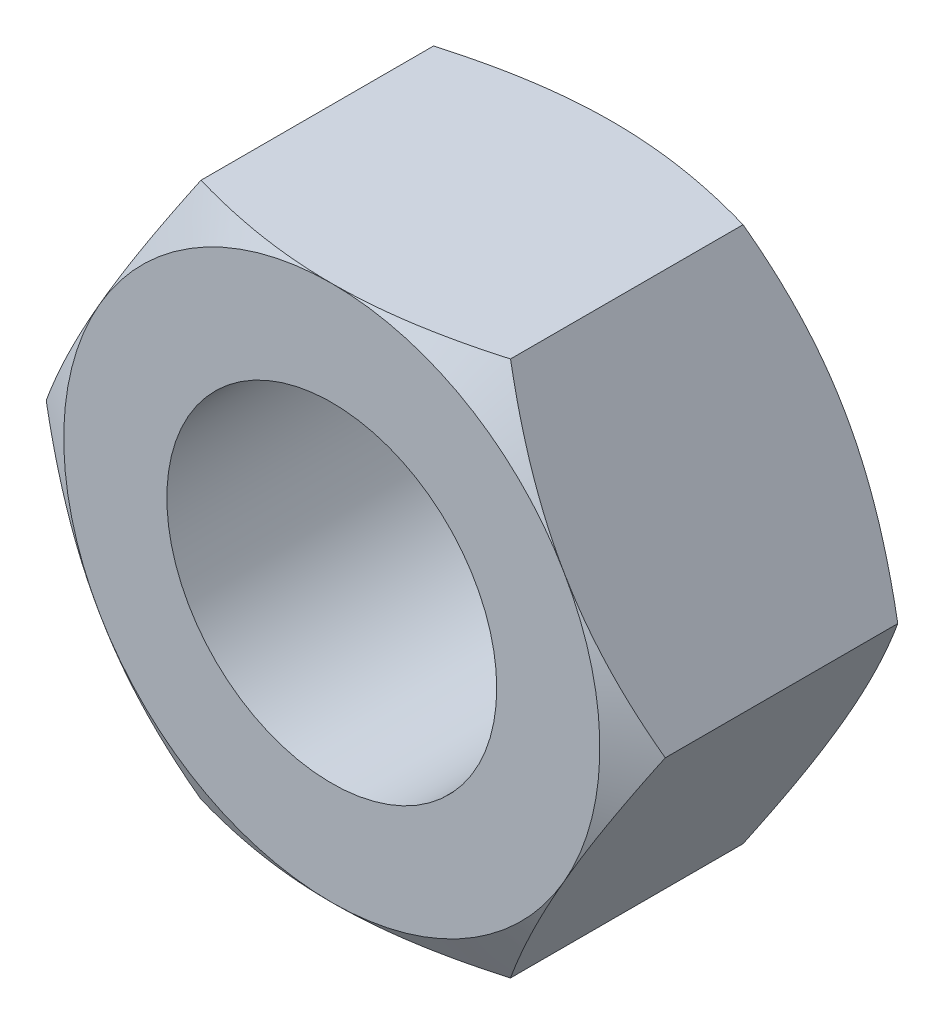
ISO-10303-21;
HEADER;
FILE_DESCRIPTION(('STEP AP214'),'2;1');
FILE_NAME('part.step','',(''),(''),'','','');
FILE_SCHEMA(('AUTOMOTIVE_DESIGN { 1 0 10303 214 1 1 1 1 }'));
ENDSEC;
DATA;
#1=APPLICATION_CONTEXT('core data for automotive mechanical design processes');
#2=APPLICATION_PROTOCOL_DEFINITION('international standard','automotive_design',2000,#1);
#3=PRODUCT_CONTEXT('',#1,'mechanical');
#4=PRODUCT('Part','Part','',(#3));
#5=PRODUCT_RELATED_PRODUCT_CATEGORY('part','',(#4));
#6=PRODUCT_DEFINITION_FORMATION('','',#4);
#7=PRODUCT_DEFINITION_CONTEXT('part definition',#1,'design');
#8=PRODUCT_DEFINITION('design','',#6,#7);
#9=PRODUCT_DEFINITION_SHAPE('','',#8);
#10=(LENGTH_UNIT() NAMED_UNIT(*) SI_UNIT(.MILLI.,.METRE.));
#11=(NAMED_UNIT(*) PLANE_ANGLE_UNIT() SI_UNIT($,.RADIAN.));
#12=(NAMED_UNIT(*) SI_UNIT($,.STERADIAN.) SOLID_ANGLE_UNIT());
#13=UNCERTAINTY_MEASURE_WITH_UNIT(LENGTH_MEASURE(1.E-05),#10,'distance_accuracy_value','');
#14=(GEOMETRIC_REPRESENTATION_CONTEXT(3) GLOBAL_UNCERTAINTY_ASSIGNED_CONTEXT((#13)) GLOBAL_UNIT_ASSIGNED_CONTEXT((#10,
#11,#12)) REPRESENTATION_CONTEXT('',''));
#15=CARTESIAN_POINT('',(0.,0.,0.));
#16=DIRECTION('',(0.,0.,1.));
#17=DIRECTION('',(1.,0.,0.));
#18=AXIS2_PLACEMENT_3D('',#15,#16,#17);
#19=CARTESIAN_POINT('',(-7.5055534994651,0.,6.80000000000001));
#20=DIRECTION('',(0.86602540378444,-0.499999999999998,0.));
#21=DIRECTION('',(0.499999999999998,0.86602540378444,0.));
#22=AXIS2_PLACEMENT_3D('',#19,#20,#21);
#23=PLANE('',#22);
#24=DIRECTION('',(0.,0.,-1.));
#25=VECTOR('',#24,1.);
#26=CARTESIAN_POINT('',(-7.5055534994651,0.,6.80000000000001));
#27=LINE('',#26,#25);
#28=CARTESIAN_POINT('',(-7.5055534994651,0.,6.21944341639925));
#29=VERTEX_POINT('',#28);
#30=CARTESIAN_POINT('',(-7.5055534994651,0.,0.580556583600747));
#31=VERTEX_POINT('',#30);
#32=EDGE_CURVE('E135',#29,#31,#27,.T.);
#33=ORIENTED_EDGE('',*,*,#32,.F.);
#34=CARTESIAN_POINT('',(-7.50566896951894,-0.000200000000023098,6.21937674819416));
#35=CARTESIAN_POINT('',(-7.42317863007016,0.142677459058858,6.26699557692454));
#36=CARTESIAN_POINT('',(-7.34038072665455,0.286087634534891,6.31245329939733));
#37=CARTESIAN_POINT('',(-7.17411251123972,0.574072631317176,6.39845131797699));
#38=CARTESIAN_POINT('',(-7.09064192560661,0.718647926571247,6.43898949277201));
#39=CARTESIAN_POINT('',(-6.83889369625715,1.15468865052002,6.55242899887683));
#40=CARTESIAN_POINT('',(-6.66962231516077,1.44787528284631,6.6169521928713));
#41=CARTESIAN_POINT('',(-6.41631077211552,1.88662374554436,6.69261341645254));
#42=CARTESIAN_POINT('',(-6.33302748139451,2.03087463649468,6.71416714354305));
#43=CARTESIAN_POINT('',(-6.1660845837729,2.32002821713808,6.75030968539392));
#44=CARTESIAN_POINT('',(-6.0824250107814,2.46493084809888,6.76489911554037));
#45=CARTESIAN_POINT('',(-5.91496056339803,2.75498777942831,6.78674124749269));
#46=CARTESIAN_POINT('',(-5.83115596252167,2.9001416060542,6.79400227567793));
#47=CARTESIAN_POINT('',(-5.66347396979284,3.19057533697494,6.8010396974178));
#48=CARTESIAN_POINT('',(-5.57959658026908,3.33585523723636,6.80081632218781));
#49=CARTESIAN_POINT('',(-5.34979921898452,3.7338759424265,6.78991654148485));
#50=CARTESIAN_POINT('',(-5.20395446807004,3.98648646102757,6.77161818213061));
#51=CARTESIAN_POINT('',(-4.91323365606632,4.49002967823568,6.71359365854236));
#52=CARTESIAN_POINT('',(-4.76835861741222,4.74096060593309,6.67384766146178));
#53=CARTESIAN_POINT('',(-4.47705272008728,5.24551722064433,6.57449409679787));
#54=CARTESIAN_POINT('',(-4.33065861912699,5.49907924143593,6.51446557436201));
#55=CARTESIAN_POINT('',(-4.0400535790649,6.00242193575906,6.37822500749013));
#56=CARTESIAN_POINT('',(-3.89583891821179,6.25220905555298,6.30204496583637));
#57=CARTESIAN_POINT('',(-3.75266127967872,6.5002,6.21937674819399));
#58=B_SPLINE_CURVE_WITH_KNOTS('',3,(#34,#35,#36,#37,#38,#39,#40,#41,#42,#43,#44,#45,#46,#47,#48,
#49,#50,#51,#52,#53,#54,#55,#56,#57),.UNSPECIFIED.,.F.,.F.,(4,2,2,2,2,2,2,2,2,2,2,4),(0.,
0.515105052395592,1.03043143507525,2.06322554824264,2.56697389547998,3.07067772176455,
3.57380860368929,4.07692394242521,4.95279354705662,5.82947446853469,6.7255991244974,
7.61996451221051),.UNSPECIFIED.);
#59=CARTESIAN_POINT('',(-5.62916512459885,3.24999999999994,6.80000000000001));
#60=VERTEX_POINT('',#59);
#61=EDGE_CURVE('E118',#29,#60,#58,.T.);
#62=ORIENTED_EDGE('',*,*,#61,.T.);
#63=CARTESIAN_POINT('',(-3.7527767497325,6.5,6.21944341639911));
#64=VERTEX_POINT('',#63);
#65=EDGE_CURVE('E128',#60,#64,#58,.T.);
#66=ORIENTED_EDGE('',*,*,#65,.T.);
#67=DIRECTION('',(0.,0.,-1.));
#68=VECTOR('',#67,1.);
#69=CARTESIAN_POINT('',(-3.75277674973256,6.5,6.79999999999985));
#70=LINE('',#69,#68);
#71=CARTESIAN_POINT('',(-3.75277674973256,6.49999999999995,0.580556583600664));
#72=VERTEX_POINT('',#71);
#73=EDGE_CURVE('E158',#64,#72,#70,.T.);
#74=ORIENTED_EDGE('',*,*,#73,.T.);
#75=CARTESIAN_POINT('',(-3.75266127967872,6.50019999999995,0.580623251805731));
#76=CARTESIAN_POINT('',(-3.83515161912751,6.35732254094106,0.533004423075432));
#77=CARTESIAN_POINT('',(-3.91794952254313,6.21391236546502,0.487546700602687));
#78=CARTESIAN_POINT('',(-4.08421773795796,5.92592736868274,0.401548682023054));
#79=CARTESIAN_POINT('',(-4.16768832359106,5.78135207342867,0.361010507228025));
#80=CARTESIAN_POINT('',(-4.41943655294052,5.34531134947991,0.247571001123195));
#81=CARTESIAN_POINT('',(-4.5887079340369,5.05212471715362,0.183047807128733));
#82=CARTESIAN_POINT('',(-4.84201947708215,4.61337625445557,0.107386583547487));
#83=CARTESIAN_POINT('',(-4.92530276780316,4.46912536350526,0.0858328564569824));
#84=CARTESIAN_POINT('',(-5.09224566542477,4.17997178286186,0.049690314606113));
#85=CARTESIAN_POINT('',(-5.17590523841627,4.03506915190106,0.0351008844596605));
#86=CARTESIAN_POINT('',(-5.34336968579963,3.74501222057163,0.0132587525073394));
#87=CARTESIAN_POINT('',(-5.42717428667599,3.59985839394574,0.00599772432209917));
#88=CARTESIAN_POINT('',(-5.59485627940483,3.309424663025,-0.00103969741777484));
#89=CARTESIAN_POINT('',(-5.67873366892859,3.16414476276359,-0.000816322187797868));
#90=CARTESIAN_POINT('',(-5.90853103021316,2.76612405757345,0.0100834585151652));
#91=CARTESIAN_POINT('',(-6.05437578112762,2.51351353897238,0.0283818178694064));
#92=CARTESIAN_POINT('',(-6.34509659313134,2.00997032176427,0.0864063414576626));
#93=CARTESIAN_POINT('',(-6.48997163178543,1.75903939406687,0.126152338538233));
#94=CARTESIAN_POINT('',(-6.78127752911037,1.25448277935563,0.22550590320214));
#95=CARTESIAN_POINT('',(-6.92767163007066,1.00092075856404,0.285534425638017));
#96=CARTESIAN_POINT('',(-7.21827667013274,0.497578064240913,0.421774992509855));
#97=CARTESIAN_POINT('',(-7.36249133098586,0.247790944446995,0.497955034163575));
#98=CARTESIAN_POINT('',(-7.50566896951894,-0.000200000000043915,0.580623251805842));
#99=B_SPLINE_CURVE_WITH_KNOTS('',3,(#75,#76,#77,#78,#79,#80,#81,#82,#83,#84,#85,#86,#87,#88,#89,
#90,#91,#92,#93,#94,#95,#96,#97,#98),.UNSPECIFIED.,.F.,.F.,(4,2,2,2,2,2,2,2,2,2,2,4),(0.,
0.51510505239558,1.03043143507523,2.0632255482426,2.56697389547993,3.07067772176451,
3.57380860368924,4.07692394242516,4.95279354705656,5.82947446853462,6.72559912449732,
7.6199645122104),.UNSPECIFIED.);
#100=CARTESIAN_POINT('',(-5.62916512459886,3.24999999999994,0.));
#101=VERTEX_POINT('',#100);
#102=EDGE_CURVE('E160',#72,#101,#99,.T.);
#103=ORIENTED_EDGE('',*,*,#102,.T.);
#104=EDGE_CURVE('E143',#101,#31,#99,.T.);
#105=ORIENTED_EDGE('',*,*,#104,.T.);
#106=EDGE_LOOP('',(#33,#62,#66,#74,#103,#105));
#107=FACE_BOUND('',#106,.T.);
#108=ADVANCED_FACE('F29',(#107),#23,.F.);
#109=CARTESIAN_POINT('',(-3.75277674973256,-6.5,6.79999999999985));
#110=DIRECTION('',(0.86602540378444,0.499999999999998,0.));
#111=DIRECTION('',(-0.499999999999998,0.86602540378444,0.));
#112=AXIS2_PLACEMENT_3D('',#109,#110,#111);
#113=PLANE('',#112);
#114=DIRECTION('',(0.,0.,-1.));
#115=VECTOR('',#114,1.);
#116=CARTESIAN_POINT('',(-3.75277674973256,-6.5,6.79999999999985));
#117=LINE('',#116,#115);
#118=CARTESIAN_POINT('',(-3.75277674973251,-6.5,6.21944341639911));
#119=VERTEX_POINT('',#118);
#120=CARTESIAN_POINT('',(-3.75277674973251,-6.50000000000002,0.580556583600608));
#121=VERTEX_POINT('',#120);
#122=EDGE_CURVE('E145',#119,#121,#117,.T.);
#123=ORIENTED_EDGE('',*,*,#122,.F.);
#124=CARTESIAN_POINT('',(-3.75266127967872,-6.5002,6.21937674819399));
#125=CARTESIAN_POINT('',(-3.83515161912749,-6.35732254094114,6.26699557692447));
#126=CARTESIAN_POINT('',(-3.9179495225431,-6.21391236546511,6.31245329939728));
#127=CARTESIAN_POINT('',(-4.08421773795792,-5.92592736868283,6.39845131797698));
#128=CARTESIAN_POINT('',(-4.16768832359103,-5.78135207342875,6.43898949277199));
#129=CARTESIAN_POINT('',(-4.4194365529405,-5.34531134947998,6.55242899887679));
#130=CARTESIAN_POINT('',(-4.58870793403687,-5.0521247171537,6.61695219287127));
#131=CARTESIAN_POINT('',(-4.84201947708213,-4.61337625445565,6.69261341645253));
#132=CARTESIAN_POINT('',(-4.92530276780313,-4.46912536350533,6.71416714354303));
#133=CARTESIAN_POINT('',(-5.09224566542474,-4.17997178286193,6.7503096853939));
#134=CARTESIAN_POINT('',(-5.17590523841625,-4.03506915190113,6.76489911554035));
#135=CARTESIAN_POINT('',(-5.34336968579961,-3.74501222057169,6.78674124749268));
#136=CARTESIAN_POINT('',(-5.42717428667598,-3.5998583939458,6.79400227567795));
#137=CARTESIAN_POINT('',(-5.59485627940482,-3.30942466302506,6.80103969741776));
#138=CARTESIAN_POINT('',(-5.67873366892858,-3.16414476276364,6.8008163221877));
#139=CARTESIAN_POINT('',(-5.90853103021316,-2.7661240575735,6.78991654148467));
#140=CARTESIAN_POINT('',(-6.05437578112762,-2.51351353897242,6.77161818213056));
#141=CARTESIAN_POINT('',(-6.34509659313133,-2.00997032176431,6.7135936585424));
#142=CARTESIAN_POINT('',(-6.48997163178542,-1.75903939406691,6.6738476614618));
#143=CARTESIAN_POINT('',(-6.78127752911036,-1.25448277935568,6.57449409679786));
#144=CARTESIAN_POINT('',(-6.92767163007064,-1.0009207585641,6.514465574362));
#145=CARTESIAN_POINT('',(-7.21827667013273,-0.497578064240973,6.37822500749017));
#146=CARTESIAN_POINT('',(-7.36249133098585,-0.247790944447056,6.30204496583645));
#147=CARTESIAN_POINT('',(-7.50566896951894,0.000199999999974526,6.21937674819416));
#148=B_SPLINE_CURVE_WITH_KNOTS('',3,(#124,#125,#126,#127,#128,#129,#130,#131,#132,#133,#134,
#135,#136,#137,#138,#139,#140,#141,#142,#143,#144,#145,#146,#147),.UNSPECIFIED.,.F.,.F.,(4,2,2,
2,2,2,2,2,2,2,2,4),(0.,0.515105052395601,1.03043143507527,2.06322554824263,2.56697389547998,
3.07067772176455,3.5738086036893,4.07692394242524,4.95279354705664,5.82947446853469,
6.72559912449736,7.61996451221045),.UNSPECIFIED.);
#149=CARTESIAN_POINT('',(-5.62916512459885,-3.24999999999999,6.79999999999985));
#150=VERTEX_POINT('',#149);
#151=EDGE_CURVE('E137',#119,#150,#148,.T.);
#152=ORIENTED_EDGE('',*,*,#151,.T.);
#153=EDGE_CURVE('E121',#150,#29,#148,.T.);
#154=ORIENTED_EDGE('',*,*,#153,.T.);
#155=ORIENTED_EDGE('',*,*,#32,.T.);
#156=CARTESIAN_POINT('',(-7.50566896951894,0.000199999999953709,0.580623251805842));
#157=CARTESIAN_POINT('',(-7.42317863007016,-0.142677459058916,0.53300442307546));
#158=CARTESIAN_POINT('',(-7.34038072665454,-0.286087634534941,0.487546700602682));
#159=CARTESIAN_POINT('',(-7.17411251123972,-0.574072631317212,0.401548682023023));
#160=CARTESIAN_POINT('',(-7.09064192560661,-0.718647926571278,0.361010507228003));
#161=CARTESIAN_POINT('',(-6.83889369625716,-1.15468865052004,0.247571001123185));
#162=CARTESIAN_POINT('',(-6.66962231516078,-1.44787528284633,0.183047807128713));
#163=CARTESIAN_POINT('',(-6.41631077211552,-1.88662374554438,0.107386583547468));
#164=CARTESIAN_POINT('',(-6.33302748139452,-2.0308746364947,0.0858328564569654));
#165=CARTESIAN_POINT('',(-6.16608458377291,-2.32002821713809,0.0496903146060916));
#166=CARTESIAN_POINT('',(-6.08242501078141,-2.46493084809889,0.035100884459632));
#167=CARTESIAN_POINT('',(-5.91496056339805,-2.75498777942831,0.0132587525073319));
#168=CARTESIAN_POINT('',(-5.8311559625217,-2.9001416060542,0.00599772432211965));
#169=CARTESIAN_POINT('',(-5.66347396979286,-3.19057533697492,-0.00103969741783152));
#170=CARTESIAN_POINT('',(-5.57959658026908,-3.33585523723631,-0.000816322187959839));
#171=CARTESIAN_POINT('',(-5.34979921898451,-3.73387594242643,0.010083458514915));
#172=CARTESIAN_POINT('',(-5.20395446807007,-3.98648646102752,0.0283818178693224));
#173=CARTESIAN_POINT('',(-4.91323365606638,-4.49002967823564,0.086406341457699));
#174=CARTESIAN_POINT('',(-4.76835861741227,-4.74096060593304,0.126152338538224));
#175=CARTESIAN_POINT('',(-4.47705272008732,-5.24551722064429,0.225505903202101));
#176=CARTESIAN_POINT('',(-4.33065861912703,-5.49907924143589,0.285534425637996));
#177=CARTESIAN_POINT('',(-4.04005357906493,-6.00242193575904,0.421774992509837));
#178=CARTESIAN_POINT('',(-3.89583891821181,-6.25220905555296,0.497955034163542));
#179=CARTESIAN_POINT('',(-3.75266127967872,-6.50020000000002,0.580623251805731));
#180=B_SPLINE_CURVE_WITH_KNOTS('',3,(#156,#157,#158,#159,#160,#161,#162,#163,#164,#165,#166,
#167,#168,#169,#170,#171,#172,#173,#174,#175,#176,#177,#178,#179),.UNSPECIFIED.,.F.,.F.,(4,2,2,
2,2,2,2,2,2,2,2,4),(0.,0.515105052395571,1.03043143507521,2.06322554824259,2.56697389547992,
3.07067772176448,3.57380860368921,4.07692394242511,4.95279354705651,5.82947446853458,
6.72559912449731,7.6199645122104),.UNSPECIFIED.);
#181=CARTESIAN_POINT('',(-5.62916512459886,-3.24999999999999,-1.94289029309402E-13));
#182=VERTEX_POINT('',#181);
#183=EDGE_CURVE('E166',#31,#182,#180,.T.);
#184=ORIENTED_EDGE('',*,*,#183,.T.);
#185=EDGE_CURVE('E167',#182,#121,#180,.T.);
#186=ORIENTED_EDGE('',*,*,#185,.T.);
#187=EDGE_LOOP('',(#123,#152,#154,#155,#184,#186));
#188=FACE_BOUND('',#187,.T.);
#189=ADVANCED_FACE('F133',(#188),#113,.F.);
#190=CARTESIAN_POINT('',(3.75277674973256,-6.50000000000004,6.80000000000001));
#191=DIRECTION('',(0.,1.,0.));
#192=DIRECTION('',(-1.,0.,0.));
#193=AXIS2_PLACEMENT_3D('',#190,#191,#192);
#194=PLANE('',#193);
#195=DIRECTION('',(0.,0.,-1.));
#196=VECTOR('',#195,1.);
#197=CARTESIAN_POINT('',(3.75277674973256,-6.50000000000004,6.80000000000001));
#198=LINE('',#197,#196);
#199=CARTESIAN_POINT('',(3.75277674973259,-6.5,6.21944341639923));
#200=VERTEX_POINT('',#199);
#201=CARTESIAN_POINT('',(3.75277674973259,-6.50000000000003,0.580556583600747));
#202=VERTEX_POINT('',#201);
#203=EDGE_CURVE('E150',#200,#202,#198,.T.);
#204=ORIENTED_EDGE('',*,*,#203,.F.);
#205=CARTESIAN_POINT('',(-9.95291930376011,-6.5,3.68957529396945));
#206=CARTESIAN_POINT('',(-9.66753246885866,-6.50000000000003,3.82748998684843));
#207=CARTESIAN_POINT('',(-9.38147088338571,-6.50000000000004,3.96403369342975));
#208=CARTESIAN_POINT('',(-8.80763337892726,-6.50000000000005,4.23359570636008));
#209=CARTESIAN_POINT('',(-8.51985717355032,-6.50000000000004,4.36661340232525));
#210=CARTESIAN_POINT('',(-7.94067105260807,-6.50000000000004,4.62904071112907));
#211=CARTESIAN_POINT('',(-7.64924976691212,-6.50000000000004,4.75842532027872));
#212=CARTESIAN_POINT('',(-7.0640119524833,-6.50000000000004,5.01163715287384));
#213=CARTESIAN_POINT('',(-6.77019554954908,-6.50000000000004,5.13546466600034));
#214=CARTESIAN_POINT('',(-6.17605277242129,-6.50000000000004,5.37755469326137));
#215=CARTESIAN_POINT('',(-5.87569076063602,-6.50000000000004,5.49573022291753));
#216=CARTESIAN_POINT('',(-5.27142371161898,-6.50000000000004,5.72282573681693));
#217=CARTESIAN_POINT('',(-4.96751828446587,-6.50000000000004,5.83174469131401));
#218=CARTESIAN_POINT('',(-4.35630617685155,-6.50000000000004,6.03740073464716));
#219=CARTESIAN_POINT('',(-4.0490082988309,-6.50000000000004,6.13416372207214));
#220=CARTESIAN_POINT('',(-3.43004071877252,-6.50000000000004,6.31236415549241));
#221=CARTESIAN_POINT('',(-3.11837243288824,-6.50000000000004,6.39380644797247));
#222=CARTESIAN_POINT('',(-2.49046612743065,-6.50000000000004,6.53741588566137));
#223=CARTESIAN_POINT('',(-2.17422691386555,-6.50000000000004,6.59957789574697));
#224=CARTESIAN_POINT('',(-1.53789143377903,-6.50000000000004,6.70042581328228));
#225=CARTESIAN_POINT('',(-1.21779516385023,-6.50000000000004,6.73911169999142));
#226=CARTESIAN_POINT('',(-0.73714136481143,-6.50000000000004,6.77705347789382));
#227=CARTESIAN_POINT('',(-0.577336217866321,-6.50000000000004,6.78635482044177));
#228=CARTESIAN_POINT('',(-0.257468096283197,-6.50000000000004,6.79818593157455));
#229=CARTESIAN_POINT('',(-0.097405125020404,-6.50000000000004,6.80071578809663));
#230=CARTESIAN_POINT('',(0.222636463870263,-6.50000000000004,6.79893596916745));
#231=CARTESIAN_POINT('',(0.382615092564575,-6.50000000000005,6.79462821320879));
#232=CARTESIAN_POINT('',(0.702251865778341,-6.50000000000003,6.77928234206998));
#233=CARTESIAN_POINT('',(0.861909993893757,-6.5,6.76824389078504));
#234=CARTESIAN_POINT('',(1.24887194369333,-6.49999999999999,6.73356297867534));
#235=CARTESIAN_POINT('',(1.47587839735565,-6.50000000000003,6.70654793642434));
#236=CARTESIAN_POINT('',(1.92815183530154,-6.50000000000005,6.64040986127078));
#237=CARTESIAN_POINT('',(2.15341832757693,-6.50000000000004,6.60128352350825));
#238=CARTESIAN_POINT('',(2.60202592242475,-6.50000000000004,6.51231047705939));
#239=CARTESIAN_POINT('',(2.82536499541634,-6.50000000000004,6.46245363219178));
#240=CARTESIAN_POINT('',(3.26974530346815,-6.50000000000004,6.35354078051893));
#241=CARTESIAN_POINT('',(3.49078675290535,-6.50000000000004,6.29448564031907));
#242=CARTESIAN_POINT('',(3.93601601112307,-6.50000000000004,6.16704532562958));
#243=CARTESIAN_POINT('',(4.16014813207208,-6.50000000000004,6.09846693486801));
#244=CARTESIAN_POINT('',(4.60604329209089,-6.50000000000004,5.95453421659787));
#245=CARTESIAN_POINT('',(4.82780784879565,-6.50000000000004,5.87918456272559));
#246=CARTESIAN_POINT('',(5.26807801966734,-6.50000000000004,5.72326573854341));
#247=CARTESIAN_POINT('',(5.48659495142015,-6.50000000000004,5.64272833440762));
#248=CARTESIAN_POINT('',(5.92193342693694,-6.50000000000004,5.47692644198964));
#249=CARTESIAN_POINT('',(6.1387542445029,-6.50000000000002,5.39166004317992));
#250=CARTESIAN_POINT('',(6.35478737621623,-6.5,5.30449694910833));
#251=B_SPLINE_CURVE_WITH_KNOTS('',3,(#205,#206,#207,#208,#209,#210,#211,#212,#213,#214,#215,
#216,#217,#218,#219,#220,#221,#222,#223,#224,#225,#226,#227,#228,#229,#230,#231,#232,#233,#234,
#235,#236,#237,#238,#239,#240,#241,#242,#243,#244,#245,#246,#247,#248,#249,#250),.UNSPECIFIED.,
.F.,.F.,(4,2,2,2,2,2,2,2,2,2,2,2,2,2,2,2,2,2,2,2,2,2,4),(0.,0.950904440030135,1.90197242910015,
2.85848299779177,3.81494364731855,4.78314666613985,5.75145725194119,6.71766851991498,
7.68357362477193,8.64973576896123,9.61589876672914,10.0960037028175,10.5761024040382,
11.0560663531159,11.5360542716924,12.221497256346,12.9071274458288,13.5934081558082,
14.2796242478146,14.9826609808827,15.685216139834,16.3838168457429,17.0827018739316),.UNSPECIFIED.);
#252=CARTESIAN_POINT('',(0.,-6.5,6.79999999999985));
#253=VERTEX_POINT('',#252);
#254=EDGE_CURVE('E231',#200,#253,#251,.F.);
#255=ORIENTED_EDGE('',*,*,#254,.T.);
#256=EDGE_CURVE('E226',#253,#119,#251,.F.);
#257=ORIENTED_EDGE('',*,*,#256,.T.);
#258=ORIENTED_EDGE('',*,*,#122,.T.);
#259=CARTESIAN_POINT('',(-9.9529193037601,-6.5,3.11042470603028));
#260=CARTESIAN_POINT('',(-9.66753246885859,-6.50000000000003,2.97251001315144));
#261=CARTESIAN_POINT('',(-9.38147088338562,-6.50000000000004,2.83596630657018));
#262=CARTESIAN_POINT('',(-8.80763337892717,-6.50000000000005,2.5664042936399));
#263=CARTESIAN_POINT('',(-8.51985717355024,-6.50000000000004,2.43338659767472));
#264=CARTESIAN_POINT('',(-7.940671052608,-6.50000000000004,2.17095928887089));
#265=CARTESIAN_POINT('',(-7.64924976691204,-6.50000000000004,2.04157467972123));
#266=CARTESIAN_POINT('',(-7.06401195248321,-6.50000000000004,1.78836284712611));
#267=CARTESIAN_POINT('',(-6.77019554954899,-6.50000000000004,1.66453533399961));
#268=CARTESIAN_POINT('',(-6.17605277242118,-6.50000000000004,1.42244530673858));
#269=CARTESIAN_POINT('',(-5.87569076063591,-6.50000000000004,1.30426977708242));
#270=CARTESIAN_POINT('',(-5.27142371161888,-6.50000000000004,1.07717426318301));
#271=CARTESIAN_POINT('',(-4.96751828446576,-6.50000000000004,0.968255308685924));
#272=CARTESIAN_POINT('',(-4.35630617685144,-6.50000000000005,0.76259926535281));
#273=CARTESIAN_POINT('',(-4.04900829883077,-6.50000000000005,0.665836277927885));
#274=CARTESIAN_POINT('',(-3.43004071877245,-6.50000000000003,0.487635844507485));
#275=CARTESIAN_POINT('',(-3.11837243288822,-6.5,0.406193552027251));
#276=CARTESIAN_POINT('',(-2.49046612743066,-6.5,0.26258411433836));
#277=CARTESIAN_POINT('',(-2.17422691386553,-6.50000000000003,0.200422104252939));
#278=CARTESIAN_POINT('',(-1.53789143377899,-6.50000000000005,0.0995741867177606));
#279=CARTESIAN_POINT('',(-1.21779516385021,-6.50000000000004,0.060888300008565));
#280=CARTESIAN_POINT('',(-0.737141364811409,-6.50000000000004,0.0229465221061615));
#281=CARTESIAN_POINT('',(-0.577336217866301,-6.50000000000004,0.0136451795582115));
#282=CARTESIAN_POINT('',(-0.257468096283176,-6.50000000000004,0.00181406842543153));
#283=CARTESIAN_POINT('',(-0.097405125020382,-6.50000000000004,-0.000715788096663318));
#284=CARTESIAN_POINT('',(0.222636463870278,-6.50000000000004,0.00106403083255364));
#285=CARTESIAN_POINT('',(0.382615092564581,-6.50000000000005,0.00537178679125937));
#286=CARTESIAN_POINT('',(0.702251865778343,-6.50000000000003,0.0207176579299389));
#287=CARTESIAN_POINT('',(0.861909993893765,-6.5,0.0317561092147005));
#288=CARTESIAN_POINT('',(1.24887194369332,-6.49999999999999,0.0664370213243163));
#289=CARTESIAN_POINT('',(1.4758783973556,-6.50000000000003,0.0934520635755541));
#290=CARTESIAN_POINT('',(1.92815183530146,-6.50000000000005,0.159590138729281));
#291=CARTESIAN_POINT('',(2.15341832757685,-6.50000000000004,0.198716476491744));
#292=CARTESIAN_POINT('',(2.60202592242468,-6.50000000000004,0.28768952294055));
#293=CARTESIAN_POINT('',(2.82536499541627,-6.50000000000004,0.337546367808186));
#294=CARTESIAN_POINT('',(3.26974530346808,-6.50000000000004,0.446459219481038));
#295=CARTESIAN_POINT('',(3.49078675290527,-6.50000000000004,0.5055143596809));
#296=CARTESIAN_POINT('',(3.93601601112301,-6.50000000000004,0.632954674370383));
#297=CARTESIAN_POINT('',(4.16014813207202,-6.50000000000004,0.701533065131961));
#298=CARTESIAN_POINT('',(4.60604329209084,-6.50000000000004,0.845465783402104));
#299=CARTESIAN_POINT('',(4.82780784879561,-6.50000000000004,0.920815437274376));
#300=CARTESIAN_POINT('',(5.26807801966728,-6.50000000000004,1.07673426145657));
#301=CARTESIAN_POINT('',(5.48659495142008,-6.50000000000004,1.15727166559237));
#302=CARTESIAN_POINT('',(5.92193342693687,-6.50000000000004,1.32307355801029));
#303=CARTESIAN_POINT('',(6.13875424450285,-6.50000000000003,1.40833995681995));
#304=CARTESIAN_POINT('',(6.35478737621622,-6.50000000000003,1.4955030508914));
#305=B_SPLINE_CURVE_WITH_KNOTS('',3,(#259,#260,#261,#262,#263,#264,#265,#266,#267,#268,#269,
#270,#271,#272,#273,#274,#275,#276,#277,#278,#279,#280,#281,#282,#283,#284,#285,#286,#287,#288,
#289,#290,#291,#292,#293,#294,#295,#296,#297,#298,#299,#300,#301,#302,#303,#304),.UNSPECIFIED.,
.F.,.F.,(4,2,2,2,2,2,2,2,2,2,2,2,2,2,2,2,2,2,2,2,2,2,4),(0.,0.950904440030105,1.90197242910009,
2.85848299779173,3.81494364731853,4.78314666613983,5.75145725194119,6.71766851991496,
7.68357362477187,8.64973576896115,9.61589876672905,10.0960037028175,10.5761024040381,
11.0560663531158,11.5360542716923,12.2214972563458,12.9071274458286,13.5934081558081,
14.2796242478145,14.9826609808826,15.6852161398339,16.3838168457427,17.0827018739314),.UNSPECIFIED.);
#306=CARTESIAN_POINT('',(0.,-6.5,-1.94289029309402E-13));
#307=VERTEX_POINT('',#306);
#308=EDGE_CURVE('E215',#121,#307,#305,.T.);
#309=ORIENTED_EDGE('',*,*,#308,.T.);
#310=EDGE_CURVE('E209',#307,#202,#305,.T.);
#311=ORIENTED_EDGE('',*,*,#310,.T.);
#312=EDGE_LOOP('',(#204,#255,#257,#258,#309,#311));
#313=FACE_BOUND('',#312,.T.);
#314=ADVANCED_FACE('F217',(#313),#194,.F.);
#315=CARTESIAN_POINT('',(7.50555349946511,0.,6.80000000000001));
#316=DIRECTION('',(-0.86602540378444,0.499999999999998,0.));
#317=DIRECTION('',(-0.499999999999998,-0.86602540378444,0.));
#318=AXIS2_PLACEMENT_3D('',#315,#316,#317);
#319=PLANE('',#318);
#320=DIRECTION('',(0.,0.,-1.));
#321=VECTOR('',#320,1.);
#322=CARTESIAN_POINT('',(7.50555349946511,0.,6.80000000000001));
#323=LINE('',#322,#321);
#324=CARTESIAN_POINT('',(7.50555349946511,0.,6.21944341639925));
#325=VERTEX_POINT('',#324);
#326=CARTESIAN_POINT('',(7.50555349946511,0.,0.580556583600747));
#327=VERTEX_POINT('',#326);
#328=EDGE_CURVE('E154',#325,#327,#323,.T.);
#329=ORIENTED_EDGE('',*,*,#328,.F.);
#330=CARTESIAN_POINT('',(7.50566896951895,0.000199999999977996,6.21937674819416));
#331=CARTESIAN_POINT('',(7.42317863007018,-0.142677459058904,6.26699557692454));
#332=CARTESIAN_POINT('',(7.34038072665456,-0.286087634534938,6.31245329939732));
#333=CARTESIAN_POINT('',(7.17411251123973,-0.574072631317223,6.39845131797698));
#334=CARTESIAN_POINT('',(7.09064192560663,-0.718647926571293,6.438989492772));
#335=CARTESIAN_POINT('',(6.83889369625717,-1.15468865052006,6.55242899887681));
#336=CARTESIAN_POINT('',(6.66962231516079,-1.44787528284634,6.61695219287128));
#337=CARTESIAN_POINT('',(6.41631077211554,-1.88662374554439,6.69261341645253));
#338=CARTESIAN_POINT('',(6.33302748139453,-2.03087463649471,6.71416714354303));
#339=CARTESIAN_POINT('',(6.16608458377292,-2.32002821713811,6.7503096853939));
#340=CARTESIAN_POINT('',(6.08242501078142,-2.46493084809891,6.76489911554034));
#341=CARTESIAN_POINT('',(5.91496056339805,-2.75498777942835,6.78674124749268));
#342=CARTESIAN_POINT('',(5.83115596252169,-2.90014160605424,6.79400227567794));
#343=CARTESIAN_POINT('',(5.66347396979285,-3.19057533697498,6.80103969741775));
#344=CARTESIAN_POINT('',(5.57959658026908,-3.3358552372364,6.8008163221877));
#345=CARTESIAN_POINT('',(5.34979921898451,-3.73387594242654,6.78991654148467));
#346=CARTESIAN_POINT('',(5.20395446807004,-3.98648646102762,6.77161818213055));
#347=CARTESIAN_POINT('',(4.91323365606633,-4.49002967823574,6.71359365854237));
#348=CARTESIAN_POINT('',(4.76835861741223,-4.74096060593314,6.67384766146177));
#349=CARTESIAN_POINT('',(4.4770527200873,-5.24551722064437,6.57449409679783));
#350=CARTESIAN_POINT('',(4.33065861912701,-5.49907924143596,6.51446557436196));
#351=CARTESIAN_POINT('',(4.04005357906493,-6.00242193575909,6.37822500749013));
#352=CARTESIAN_POINT('',(3.89583891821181,-6.25220905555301,6.30204496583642));
#353=CARTESIAN_POINT('',(3.75266127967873,-6.50020000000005,6.21937674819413));
#354=B_SPLINE_CURVE_WITH_KNOTS('',3,(#330,#331,#332,#333,#334,#335,#336,#337,#338,#339,#340,
#341,#342,#343,#344,#345,#346,#347,#348,#349,#350,#351,#352,#353),.UNSPECIFIED.,.F.,.F.,(4,2,2,
2,2,2,2,2,2,2,2,4),(0.,0.515105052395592,1.03043143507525,2.06322554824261,2.56697389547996,
3.07067772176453,3.57380860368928,4.07692394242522,4.95279354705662,5.82947446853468,
6.72559912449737,7.61996451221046),.UNSPECIFIED.);
#355=CARTESIAN_POINT('',(5.62916512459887,-3.25000000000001,6.79999999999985));
#356=VERTEX_POINT('',#355);
#357=EDGE_CURVE('E138',#325,#356,#354,.T.);
#358=ORIENTED_EDGE('',*,*,#357,.T.);
#359=EDGE_CURVE('E232',#356,#200,#354,.T.);
#360=ORIENTED_EDGE('',*,*,#359,.T.);
#361=ORIENTED_EDGE('',*,*,#203,.T.);
#362=CARTESIAN_POINT('',(3.75266127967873,-6.50020000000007,0.58062325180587));
#363=CARTESIAN_POINT('',(3.83515161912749,-6.35732254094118,0.533004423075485));
#364=CARTESIAN_POINT('',(3.9179495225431,-6.21391236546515,0.487546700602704));
#365=CARTESIAN_POINT('',(4.08421773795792,-5.92592736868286,0.401548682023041));
#366=CARTESIAN_POINT('',(4.16768832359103,-5.78135207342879,0.36101050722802));
#367=CARTESIAN_POINT('',(4.41943655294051,-5.34531134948,0.247571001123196));
#368=CARTESIAN_POINT('',(4.58870793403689,-5.0521247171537,0.183047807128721));
#369=CARTESIAN_POINT('',(4.84201947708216,-4.61337625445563,0.107386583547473));
#370=CARTESIAN_POINT('',(4.92530276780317,-4.46912536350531,0.0858328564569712));
#371=CARTESIAN_POINT('',(5.09224566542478,-4.17997178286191,0.049690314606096));
#372=CARTESIAN_POINT('',(5.17590523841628,-4.03506915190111,0.0351008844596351));
#373=CARTESIAN_POINT('',(5.34336968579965,-3.74501222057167,0.0132587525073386));
#374=CARTESIAN_POINT('',(5.42717428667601,-3.59985839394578,0.00599772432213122));
#375=CARTESIAN_POINT('',(5.59485627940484,-3.30942466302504,-0.00103969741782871));
#376=CARTESIAN_POINT('',(5.6787336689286,-3.16414476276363,-0.000816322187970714));
#377=CARTESIAN_POINT('',(5.90853103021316,-2.7661240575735,0.0100834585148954));
#378=CARTESIAN_POINT('',(6.05437578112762,-2.51351353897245,0.0283818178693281));
#379=CARTESIAN_POINT('',(6.34509659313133,-2.00997032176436,0.0864063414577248));
#380=CARTESIAN_POINT('',(6.48997163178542,-1.75903939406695,0.126152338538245));
#381=CARTESIAN_POINT('',(6.78127752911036,-1.25448277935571,0.22550590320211));
#382=CARTESIAN_POINT('',(6.92767163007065,-1.00092075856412,0.285534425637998));
#383=CARTESIAN_POINT('',(7.21827667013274,-0.49757806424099,0.42177499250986));
#384=CARTESIAN_POINT('',(7.36249133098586,-0.247790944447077,0.497955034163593));
#385=CARTESIAN_POINT('',(7.50566896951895,0.000199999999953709,0.580623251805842));
#386=B_SPLINE_CURVE_WITH_KNOTS('',3,(#362,#363,#364,#365,#366,#367,#368,#369,#370,#371,#372,
#373,#374,#375,#376,#377,#378,#379,#380,#381,#382,#383,#384,#385),.UNSPECIFIED.,.F.,.F.,(4,2,2,
2,2,2,2,2,2,2,2,4),(0.,0.515105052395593,1.03043143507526,2.06322554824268,2.56697389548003,
3.07067772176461,3.57380860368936,4.07692394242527,4.95279354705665,5.8294744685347,
6.7255991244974,7.61996451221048),.UNSPECIFIED.);
#387=CARTESIAN_POINT('',(5.62916512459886,-3.24999999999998,-1.94289029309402E-13));
#388=VERTEX_POINT('',#387);
#389=EDGE_CURVE('E216',#202,#388,#386,.T.);
#390=ORIENTED_EDGE('',*,*,#389,.T.);
#391=EDGE_CURVE('E204',#388,#327,#386,.T.);
#392=ORIENTED_EDGE('',*,*,#391,.T.);
#393=EDGE_LOOP('',(#329,#358,#360,#361,#390,#392));
#394=FACE_BOUND('',#393,.T.);
#395=ADVANCED_FACE('F220',(#394),#319,.F.);
#396=CARTESIAN_POINT('',(3.75277674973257,6.5,6.80000000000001));
#397=DIRECTION('',(-0.86602540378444,-0.499999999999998,0.));
#398=DIRECTION('',(0.499999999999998,-0.86602540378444,0.));
#399=AXIS2_PLACEMENT_3D('',#396,#397,#398);
#400=PLANE('',#399);
#401=DIRECTION('',(0.,0.,-1.));
#402=VECTOR('',#401,1.);
#403=CARTESIAN_POINT('',(3.75277674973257,6.5,6.80000000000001));
#404=LINE('',#403,#402);
#405=CARTESIAN_POINT('',(3.75277674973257,6.5,6.21944341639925));
#406=VERTEX_POINT('',#405);
#407=CARTESIAN_POINT('',(3.75277674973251,6.49999999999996,0.580556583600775));
#408=VERTEX_POINT('',#407);
#409=EDGE_CURVE('E156',#406,#408,#404,.T.);
#410=ORIENTED_EDGE('',*,*,#409,.F.);
#411=CARTESIAN_POINT('',(3.75266127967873,6.5002,6.21937674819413));
#412=CARTESIAN_POINT('',(3.8351516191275,6.35732254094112,6.26699557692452));
#413=CARTESIAN_POINT('',(3.91794952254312,6.21391236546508,6.3124532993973));
#414=CARTESIAN_POINT('',(4.08421773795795,5.9259273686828,6.39845131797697));
#415=CARTESIAN_POINT('',(4.16768832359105,5.78135207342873,6.43898949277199));
#416=CARTESIAN_POINT('',(4.41943655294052,5.34531134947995,6.55242899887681));
#417=CARTESIAN_POINT('',(4.5887079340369,5.05212471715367,6.61695219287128));
#418=CARTESIAN_POINT('',(4.84201947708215,4.61337625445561,6.69261341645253));
#419=CARTESIAN_POINT('',(4.92530276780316,4.46912536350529,6.71416714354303));
#420=CARTESIAN_POINT('',(5.09224566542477,4.17997178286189,6.7503096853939));
#421=CARTESIAN_POINT('',(5.17590523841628,4.03506915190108,6.76489911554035));
#422=CARTESIAN_POINT('',(5.34336968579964,3.74501222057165,6.78674124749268));
#423=CARTESIAN_POINT('',(5.42717428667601,3.59985839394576,6.79400227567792));
#424=CARTESIAN_POINT('',(5.59485627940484,3.30942466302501,6.80103969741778));
#425=CARTESIAN_POINT('',(5.6787336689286,3.1641447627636,6.80081632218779));
#426=CARTESIAN_POINT('',(5.90853103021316,2.76612405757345,6.78991654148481));
#427=CARTESIAN_POINT('',(6.05437578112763,2.51351353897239,6.7716181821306));
#428=CARTESIAN_POINT('',(6.34509659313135,2.00997032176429,6.71359365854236));
#429=CARTESIAN_POINT('',(6.48997163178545,1.75903939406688,6.67384766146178));
#430=CARTESIAN_POINT('',(6.78127752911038,1.25448277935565,6.57449409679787));
#431=CARTESIAN_POINT('',(6.92767163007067,1.00092075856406,6.51446557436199));
#432=CARTESIAN_POINT('',(7.21827667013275,0.497578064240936,6.37822500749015));
#433=CARTESIAN_POINT('',(7.36249133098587,0.247790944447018,6.30204496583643));
#434=CARTESIAN_POINT('',(7.50566896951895,-0.000200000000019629,6.21937674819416));
#435=B_SPLINE_CURVE_WITH_KNOTS('',3,(#411,#412,#413,#414,#415,#416,#417,#418,#419,#420,#421,
#422,#423,#424,#425,#426,#427,#428,#429,#430,#431,#432,#433,#434),.UNSPECIFIED.,.F.,.F.,(4,2,2,
2,2,2,2,2,2,2,2,4),(0.,0.515105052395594,1.03043143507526,2.06322554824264,2.56697389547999,
3.07067772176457,3.57380860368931,4.07692394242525,4.95279354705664,5.82947446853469,
6.72559912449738,7.61996451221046),.UNSPECIFIED.);
#436=CARTESIAN_POINT('',(5.62916512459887,3.24999999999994,6.79999999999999));
#437=VERTEX_POINT('',#436);
#438=EDGE_CURVE('E51',#406,#437,#435,.T.);
#439=ORIENTED_EDGE('',*,*,#438,.T.);
#440=EDGE_CURVE('E127',#437,#325,#435,.T.);
#441=ORIENTED_EDGE('',*,*,#440,.T.);
#442=ORIENTED_EDGE('',*,*,#328,.T.);
#443=CARTESIAN_POINT('',(7.50566896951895,-0.000200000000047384,0.580623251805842));
#444=CARTESIAN_POINT('',(7.42317863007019,0.142677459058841,0.533004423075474));
#445=CARTESIAN_POINT('',(7.34038072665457,0.286087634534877,0.487546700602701));
#446=CARTESIAN_POINT('',(7.17411251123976,0.574072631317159,0.401548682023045));
#447=CARTESIAN_POINT('',(7.09064192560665,0.718647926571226,0.361010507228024));
#448=CARTESIAN_POINT('',(6.83889369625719,1.15468865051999,0.247571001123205));
#449=CARTESIAN_POINT('',(6.66962231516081,1.44787528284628,0.183047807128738));
#450=CARTESIAN_POINT('',(6.41631077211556,1.88662374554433,0.107386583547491));
#451=CARTESIAN_POINT('',(6.33302748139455,2.03087463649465,0.0858328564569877));
#452=CARTESIAN_POINT('',(6.16608458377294,2.32002821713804,0.0496903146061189));
#453=CARTESIAN_POINT('',(6.08242501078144,2.46493084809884,0.035100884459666));
#454=CARTESIAN_POINT('',(5.91496056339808,2.75498777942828,0.0132587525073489));
#455=CARTESIAN_POINT('',(5.83115596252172,2.90014160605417,0.00599772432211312));
#456=CARTESIAN_POINT('',(5.66347396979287,3.1905753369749,-0.00103969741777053));
#457=CARTESIAN_POINT('',(5.57959658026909,3.33585523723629,-0.000816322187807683));
#458=CARTESIAN_POINT('',(5.34979921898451,3.73387594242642,0.0100834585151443));
#459=CARTESIAN_POINT('',(5.20395446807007,3.98648646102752,0.0283818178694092));
#460=CARTESIAN_POINT('',(4.91323365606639,4.49002967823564,0.0864063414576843));
#461=CARTESIAN_POINT('',(4.76835861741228,4.74096060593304,0.12615233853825));
#462=CARTESIAN_POINT('',(4.47705272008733,5.24551722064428,0.225505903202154));
#463=CARTESIAN_POINT('',(4.33065861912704,5.49907924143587,0.285534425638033));
#464=CARTESIAN_POINT('',(4.04005357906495,6.00242193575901,0.421774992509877));
#465=CARTESIAN_POINT('',(3.89583891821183,6.25220905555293,0.497955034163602));
#466=CARTESIAN_POINT('',(3.75266127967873,6.50019999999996,0.58062325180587));
#467=B_SPLINE_CURVE_WITH_KNOTS('',3,(#443,#444,#445,#446,#447,#448,#449,#450,#451,#452,#453,
#454,#455,#456,#457,#458,#459,#460,#461,#462,#463,#464,#465,#466),.UNSPECIFIED.,.F.,.F.,(4,2,2,
2,2,2,2,2,2,2,2,4),(0.,0.515105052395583,1.03043143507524,2.06322554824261,2.56697389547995,
3.07067772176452,3.57380860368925,4.07692394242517,4.95279354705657,5.82947446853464,
6.72559912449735,7.61996451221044),.UNSPECIFIED.);
#468=CARTESIAN_POINT('',(5.62916512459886,3.24999999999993,0.));
#469=VERTEX_POINT('',#468);
#470=EDGE_CURVE('E469',#327,#469,#467,.T.);
#471=ORIENTED_EDGE('',*,*,#470,.T.);
#472=EDGE_CURVE('E197',#469,#408,#467,.T.);
#473=ORIENTED_EDGE('',*,*,#472,.T.);
#474=EDGE_LOOP('',(#410,#439,#441,#442,#471,#473));
#475=FACE_BOUND('',#474,.T.);
#476=ADVANCED_FACE('F282',(#475),#400,.F.);
#477=CARTESIAN_POINT('',(-3.75277674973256,6.5,6.79999999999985));
#478=DIRECTION('',(0.,-1.,0.));
#479=DIRECTION('',(0.,0.,-1.));
#480=AXIS2_PLACEMENT_3D('',#477,#478,#479);
#481=PLANE('',#480);
#482=ORIENTED_EDGE('',*,*,#73,.F.);
#483=CARTESIAN_POINT('',(-9.95291698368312,6.49999999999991,3.68957641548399));
#484=CARTESIAN_POINT('',(-9.66753022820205,6.49999999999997,3.82749106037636));
#485=CARTESIAN_POINT('',(-9.38146872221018,6.49999999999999,3.96403471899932));
#486=CARTESIAN_POINT('',(-8.80763137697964,6.50000000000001,4.23359663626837));
#487=CARTESIAN_POINT('',(-8.51985525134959,6.5,4.36661428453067));
#488=CARTESIAN_POINT('',(-7.94066929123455,6.5,4.62904149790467));
#489=CARTESIAN_POINT('',(-7.64924808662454,6.5,4.75842605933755));
#490=CARTESIAN_POINT('',(-7.06401043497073,6.5,5.01163779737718));
#491=CARTESIAN_POINT('',(-6.77019411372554,6.5,5.13546526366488));
#492=CARTESIAN_POINT('',(-6.17605150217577,6.5,5.3775551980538));
#493=CARTESIAN_POINT('',(-5.87568957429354,6.5,5.49573068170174));
#494=CARTESIAN_POINT('',(-5.27142269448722,6.5,5.72282610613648));
#495=CARTESIAN_POINT('',(-4.96751735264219,6.5,5.83174501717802));
#496=CARTESIAN_POINT('',(-4.35630541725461,6.5,6.03740097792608));
#497=CARTESIAN_POINT('',(-4.04900762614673,6.5,6.13416392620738));
#498=CARTESIAN_POINT('',(-3.43004022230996,6.5,6.31236428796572));
#499=CARTESIAN_POINT('',(-3.11837202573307,6.50000000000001,6.3938065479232));
#500=CARTESIAN_POINT('',(-2.49046594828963,6.50000000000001,6.53741591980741));
#501=CARTESIAN_POINT('',(-2.17422687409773,6.5,6.59957789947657));
#502=CARTESIAN_POINT('',(-1.53789167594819,6.5,6.7004257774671));
#503=CARTESIAN_POINT('',(-1.21779554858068,6.5,6.73911165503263));
#504=CARTESIAN_POINT('',(-0.737141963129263,6.5,6.77705343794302));
#505=CARTESIAN_POINT('',(-0.577336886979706,6.5,6.78635478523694));
#506=CARTESIAN_POINT('',(-0.257468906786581,6.5,6.79818591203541));
#507=CARTESIAN_POINT('',(-0.097406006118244,6.5,6.80071577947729));
#508=CARTESIAN_POINT('',(0.222635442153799,6.5,6.79893598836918));
#509=CARTESIAN_POINT('',(0.382614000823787,6.5,6.79462824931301));
#510=CARTESIAN_POINT('',(0.702250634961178,6.5,6.77928241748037));
#511=CARTESIAN_POINT('',(0.86190869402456,6.50000000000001,6.76824398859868));
#512=CARTESIAN_POINT('',(1.24887053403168,6.50000000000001,6.73356313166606));
#513=CARTESIAN_POINT('',(1.47587694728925,6.5,6.70654812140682));
#514=CARTESIAN_POINT('',(1.928150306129,6.5,6.64041011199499));
#515=CARTESIAN_POINT('',(2.15341675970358,6.5,6.60128380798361));
#516=CARTESIAN_POINT('',(2.60202427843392,6.5,6.51231082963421));
#517=CARTESIAN_POINT('',(2.82536331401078,6.5,6.46245401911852));
#518=CARTESIAN_POINT('',(3.26974354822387,6.5,6.35354123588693));
#519=CARTESIAN_POINT('',(3.49078496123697,6.5,6.29448612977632));
#520=CARTESIAN_POINT('',(3.93601414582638,6.5,6.16704588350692));
#521=CARTESIAN_POINT('',(4.16014622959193,6.5,6.09846752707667));
#522=CARTESIAN_POINT('',(4.6060413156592,6.5,5.95453487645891));
#523=CARTESIAN_POINT('',(4.82780583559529,6.5,5.87918525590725));
#524=CARTESIAN_POINT('',(5.26807593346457,6.5,5.72326649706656));
#525=CARTESIAN_POINT('',(5.48659282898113,6.5,5.64272912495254));
#526=CARTESIAN_POINT('',(5.92193123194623,6.49999999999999,5.47692729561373));
#527=CARTESIAN_POINT('',(6.13875201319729,6.49999999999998,5.39166092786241));
#528=CARTESIAN_POINT('',(6.35478510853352,6.49999999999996,5.30449786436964));
#529=B_SPLINE_CURVE_WITH_KNOTS('',3,(#483,#484,#485,#486,#487,#488,#489,#490,#491,#492,#493,
#494,#495,#496,#497,#498,#499,#500,#501,#502,#503,#504,#505,#506,#507,#508,#509,#510,#511,#512,
#513,#514,#515,#516,#517,#518,#519,#520,#521,#522,#523,#524,#525,#526,#527,#528),.UNSPECIFIED.,
.F.,.F.,(4,2,2,2,2,2,2,2,2,2,2,2,2,2,2,2,2,2,2,2,2,2,4),(0.,0.950904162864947,1.90197187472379,
2.85848216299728,3.81494253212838,4.78314526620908,5.75145556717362,6.71766655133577,
7.6835713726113,8.64973308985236,9.61589566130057,10.0960003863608,10.5760988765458,
11.0560626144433,11.5360503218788,12.2214931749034,12.9071232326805,13.5934038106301,
14.2796197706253,14.9826563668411,15.6852113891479,16.3838119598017,17.082696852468),.UNSPECIFIED.);
#530=CARTESIAN_POINT('',(0.,6.5,6.80000000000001));
#531=VERTEX_POINT('',#530);
#532=EDGE_CURVE('E267',#64,#531,#529,.T.);
#533=ORIENTED_EDGE('',*,*,#532,.T.);
#534=EDGE_CURVE('E270',#531,#406,#529,.T.);
#535=ORIENTED_EDGE('',*,*,#534,.T.);
#536=ORIENTED_EDGE('',*,*,#409,.T.);
#537=CARTESIAN_POINT('',(-9.95291698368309,6.49999999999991,3.11042358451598));
#538=CARTESIAN_POINT('',(-9.66753022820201,6.49999999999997,2.97250893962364));
#539=CARTESIAN_POINT('',(-9.38146872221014,6.49999999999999,2.83596528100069));
#540=CARTESIAN_POINT('',(-8.8076313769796,6.50000000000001,2.56640336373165));
#541=CARTESIAN_POINT('',(-8.51985525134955,6.5,2.43338571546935));
#542=CARTESIAN_POINT('',(-7.94066929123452,6.5,2.17095850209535));
#543=CARTESIAN_POINT('',(-7.6492480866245,6.5,2.04157394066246));
#544=CARTESIAN_POINT('',(-7.06401043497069,6.5,1.78836220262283));
#545=CARTESIAN_POINT('',(-6.77019411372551,6.5,1.66453473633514));
#546=CARTESIAN_POINT('',(-6.17605150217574,6.5,1.42244480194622));
#547=CARTESIAN_POINT('',(-5.8756895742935,6.5,1.30426931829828));
#548=CARTESIAN_POINT('',(-5.27142269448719,6.5,1.07717389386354));
#549=CARTESIAN_POINT('',(-4.96751735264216,6.5,0.968254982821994));
#550=CARTESIAN_POINT('',(-4.35630541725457,6.5,0.762599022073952));
#551=CARTESIAN_POINT('',(-4.0490076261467,6.5,0.665836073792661));
#552=CARTESIAN_POINT('',(-3.43004022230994,6.5,0.487635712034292));
#553=CARTESIAN_POINT('',(-3.11837202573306,6.5,0.406193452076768));
#554=CARTESIAN_POINT('',(-2.49046594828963,6.5,0.262584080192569));
#555=CARTESIAN_POINT('',(-2.17422687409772,6.5,0.200422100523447));
#556=CARTESIAN_POINT('',(-1.53789167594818,6.5,0.0995742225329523));
#557=CARTESIAN_POINT('',(-1.21779554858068,6.5,0.060888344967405));
#558=CARTESIAN_POINT('',(-0.737141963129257,6.5,0.0229465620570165));
#559=CARTESIAN_POINT('',(-0.577336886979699,6.5,0.0136452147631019));
#560=CARTESIAN_POINT('',(-0.257468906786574,6.5,0.00181408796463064));
#561=CARTESIAN_POINT('',(-0.0974060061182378,6.5,-0.000715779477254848));
#562=CARTESIAN_POINT('',(0.222635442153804,6.5,0.00106401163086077));
#563=CARTESIAN_POINT('',(0.38261400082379,6.5,0.00537175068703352));
#564=CARTESIAN_POINT('',(0.70225063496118,6.5,0.0207175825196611));
#565=CARTESIAN_POINT('',(0.861908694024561,6.5,0.0317560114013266));
#566=CARTESIAN_POINT('',(1.24887053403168,6.5,0.0664368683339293));
#567=CARTESIAN_POINT('',(1.47587694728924,6.5,0.093451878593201));
#568=CARTESIAN_POINT('',(1.92815030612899,6.5,0.159589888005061));
#569=CARTESIAN_POINT('',(2.15341675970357,6.5,0.198716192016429));
#570=CARTESIAN_POINT('',(2.60202427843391,6.5,0.287689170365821));
#571=CARTESIAN_POINT('',(2.82536331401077,6.5,0.33754598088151));
#572=CARTESIAN_POINT('',(3.26974354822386,6.5,0.446458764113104));
#573=CARTESIAN_POINT('',(3.49078496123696,6.5,0.505513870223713));
#574=CARTESIAN_POINT('',(3.93601414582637,6.5,0.632954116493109));
#575=CARTESIAN_POINT('',(4.16014622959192,6.5,0.701532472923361));
#576=CARTESIAN_POINT('',(4.6060413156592,6.5,0.845465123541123));
#577=CARTESIAN_POINT('',(4.82780583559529,6.5,0.920814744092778));
#578=CARTESIAN_POINT('',(5.26807593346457,6.5,1.07673350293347));
#579=CARTESIAN_POINT('',(5.48659282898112,6.5,1.15727087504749));
#580=CARTESIAN_POINT('',(5.92193123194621,6.49999999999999,1.32307270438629));
#581=CARTESIAN_POINT('',(6.13875201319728,6.49999999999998,1.4083390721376));
#582=CARTESIAN_POINT('',(6.35478510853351,6.49999999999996,1.49550213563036));
#583=B_SPLINE_CURVE_WITH_KNOTS('',3,(#537,#538,#539,#540,#541,#542,#543,#544,#545,#546,#547,
#548,#549,#550,#551,#552,#553,#554,#555,#556,#557,#558,#559,#560,#561,#562,#563,#564,#565,#566,
#567,#568,#569,#570,#571,#572,#573,#574,#575,#576,#577,#578,#579,#580,#581,#582),.UNSPECIFIED.,
.F.,.F.,(4,2,2,2,2,2,2,2,2,2,2,2,2,2,2,2,2,2,2,2,2,2,4),(0.,0.950904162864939,1.90197187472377,
2.85848216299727,3.81494253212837,4.78314526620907,5.7514555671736,6.71766655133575,
7.68357137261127,8.64973308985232,9.61589566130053,10.0960003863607,10.5760988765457,
11.0560626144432,11.5360503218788,12.2214931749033,12.9071232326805,13.59340381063,
14.2796197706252,14.9826563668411,15.6852113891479,16.3838119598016,17.082696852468),.UNSPECIFIED.);
#584=CARTESIAN_POINT('',(0.,6.49999999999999,0.));
#585=VERTEX_POINT('',#584);
#586=EDGE_CURVE('E244',#408,#585,#583,.F.);
#587=ORIENTED_EDGE('',*,*,#586,.T.);
#588=EDGE_CURVE('E188',#585,#72,#583,.F.);
#589=ORIENTED_EDGE('',*,*,#588,.T.);
#590=EDGE_LOOP('',(#482,#533,#535,#536,#587,#589));
#591=FACE_BOUND('',#590,.T.);
#592=ADVANCED_FACE('F279',(#591),#481,.F.);
#593=CARTESIAN_POINT('',(0.,0.,0.580556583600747));
#594=DIRECTION('',(0.,0.,1.));
#595=DIRECTION('',(1.,0.,0.));
#596=AXIS2_PLACEMENT_3D('',#593,#594,#595);
#597=CONICAL_SURFACE('',#596,7.50555349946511,1.0471975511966);
#598=CARTESIAN_POINT('',(0.,0.,0.));
#599=DIRECTION('',(0.,0.,-1.));
#600=DIRECTION('',(-1.,0.,0.));
#601=AXIS2_PLACEMENT_3D('',#598,#599,#600);
#602=CIRCLE('',#601,6.5);
#603=EDGE_CURVE('E144',#101,#182,#602,.F.);
#604=ORIENTED_EDGE('',*,*,#603,.T.);
#605=ORIENTED_EDGE('',*,*,#183,.F.);
#606=ORIENTED_EDGE('',*,*,#104,.F.);
#607=EDGE_LOOP('',(#604,#605,#606));
#608=FACE_BOUND('',#607,.T.);
#609=ADVANCED_FACE('F178',(#608),#597,.T.);
#610=ORIENTED_EDGE('',*,*,#588,.F.);
#611=CARTESIAN_POINT('',(0.,0.,0.));
#612=DIRECTION('',(0.,0.,-1.));
#613=DIRECTION('',(-1.,0.,0.));
#614=AXIS2_PLACEMENT_3D('',#611,#612,#613);
#615=CIRCLE('',#614,6.5);
#616=EDGE_CURVE('E237',#101,#585,#615,.T.);
#617=ORIENTED_EDGE('',*,*,#616,.F.);
#618=ORIENTED_EDGE('',*,*,#102,.F.);
#619=EDGE_LOOP('',(#610,#617,#618));
#620=FACE_BOUND('',#619,.T.);
#621=ADVANCED_FACE('F172',(#620),#597,.T.);
#622=EDGE_CURVE('E148',#469,#585,#602,.F.);
#623=ORIENTED_EDGE('',*,*,#622,.T.);
#624=ORIENTED_EDGE('',*,*,#586,.F.);
#625=ORIENTED_EDGE('',*,*,#472,.F.);
#626=EDGE_LOOP('',(#623,#624,#625));
#627=FACE_BOUND('',#626,.T.);
#628=ADVANCED_FACE('F177',(#627),#597,.T.);
#629=EDGE_CURVE('E461',#388,#469,#602,.F.);
#630=ORIENTED_EDGE('',*,*,#629,.T.);
#631=ORIENTED_EDGE('',*,*,#470,.F.);
#632=ORIENTED_EDGE('',*,*,#391,.F.);
#633=EDGE_LOOP('',(#630,#631,#632));
#634=FACE_BOUND('',#633,.T.);
#635=ADVANCED_FACE('F341',(#634),#597,.T.);
#636=EDGE_CURVE('E456',#307,#388,#602,.F.);
#637=ORIENTED_EDGE('',*,*,#636,.T.);
#638=ORIENTED_EDGE('',*,*,#389,.F.);
#639=ORIENTED_EDGE('',*,*,#310,.F.);
#640=EDGE_LOOP('',(#637,#638,#639));
#641=FACE_BOUND('',#640,.T.);
#642=ADVANCED_FACE('F350',(#641),#597,.T.);
#643=EDGE_CURVE('E149',#182,#307,#602,.F.);
#644=ORIENTED_EDGE('',*,*,#643,.T.);
#645=ORIENTED_EDGE('',*,*,#308,.F.);
#646=ORIENTED_EDGE('',*,*,#185,.F.);
#647=EDGE_LOOP('',(#644,#645,#646));
#648=FACE_BOUND('',#647,.T.);
#649=ADVANCED_FACE('F326',(#648),#597,.T.);
#650=CARTESIAN_POINT('',(-3.75277674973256,6.49999999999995,-1.94289029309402E-13));
#651=DIRECTION('',(0.,0.,-1.));
#652=DIRECTION('',(-1.,0.,0.));
#653=AXIS2_PLACEMENT_3D('',#650,#651,#652);
#654=PLANE('',#653);
#655=CARTESIAN_POINT('',(0.,0.,0.));
#656=DIRECTION('',(0.,0.,-1.));
#657=DIRECTION('',(0.,1.,0.));
#658=AXIS2_PLACEMENT_3D('',#655,#656,#657);
#659=CIRCLE('',#658,4.);
#660=CARTESIAN_POINT('',(0.,3.99999999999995,0.));
#661=VERTEX_POINT('',#660);
#662=EDGE_CURVE('E444',#661,#661,#659,.T.);
#663=ORIENTED_EDGE('',*,*,#662,.F.);
#664=EDGE_LOOP('',(#663));
#665=FACE_BOUND('',#664,.T.);
#666=ORIENTED_EDGE('',*,*,#643,.F.);
#667=ORIENTED_EDGE('',*,*,#603,.F.);
#668=ORIENTED_EDGE('',*,*,#616,.T.);
#669=ORIENTED_EDGE('',*,*,#622,.F.);
#670=ORIENTED_EDGE('',*,*,#629,.F.);
#671=ORIENTED_EDGE('',*,*,#636,.F.);
#672=EDGE_LOOP('',(#666,#667,#668,#669,#670,#671));
#673=FACE_BOUND('',#672,.T.);
#674=ADVANCED_FACE('F183',(#665,#673),#654,.T.);
#675=CARTESIAN_POINT('',(0.,0.,6.80000000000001));
#676=DIRECTION('',(0.,0.,-1.));
#677=DIRECTION('',(-1.,0.,0.));
#678=AXIS2_PLACEMENT_3D('',#675,#676,#677);
#679=CONICAL_SURFACE('',#678,6.5,1.0471975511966);
#680=CARTESIAN_POINT('',(0.,0.,6.80000000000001));
#681=DIRECTION('',(0.,0.,-1.));
#682=DIRECTION('',(-1.,0.,0.));
#683=AXIS2_PLACEMENT_3D('',#680,#681,#682);
#684=CIRCLE('',#683,6.5);
#685=EDGE_CURVE('E33',#60,#150,#684,.F.);
#686=ORIENTED_EDGE('',*,*,#685,.F.);
#687=ORIENTED_EDGE('',*,*,#61,.F.);
#688=ORIENTED_EDGE('',*,*,#153,.F.);
#689=EDGE_LOOP('',(#686,#687,#688));
#690=FACE_BOUND('',#689,.T.);
#691=ADVANCED_FACE('F120',(#690),#679,.T.);
#692=CARTESIAN_POINT('',(0.,0.,6.80000000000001));
#693=DIRECTION('',(0.,0.,-1.));
#694=DIRECTION('',(-1.,0.,0.));
#695=AXIS2_PLACEMENT_3D('',#692,#693,#694);
#696=CIRCLE('',#695,6.5);
#697=EDGE_CURVE('E273',#60,#531,#696,.T.);
#698=ORIENTED_EDGE('',*,*,#697,.T.);
#699=ORIENTED_EDGE('',*,*,#532,.F.);
#700=ORIENTED_EDGE('',*,*,#65,.F.);
#701=EDGE_LOOP('',(#698,#699,#700));
#702=FACE_BOUND('',#701,.T.);
#703=ADVANCED_FACE('F382',(#702),#679,.T.);
#704=ORIENTED_EDGE('',*,*,#534,.F.);
#705=EDGE_CURVE('E453',#437,#531,#684,.F.);
#706=ORIENTED_EDGE('',*,*,#705,.F.);
#707=ORIENTED_EDGE('',*,*,#438,.F.);
#708=EDGE_LOOP('',(#704,#706,#707));
#709=FACE_BOUND('',#708,.T.);
#710=ADVANCED_FACE('F392',(#709),#679,.T.);
#711=ORIENTED_EDGE('',*,*,#440,.F.);
#712=EDGE_CURVE('E454',#356,#437,#684,.F.);
#713=ORIENTED_EDGE('',*,*,#712,.F.);
#714=ORIENTED_EDGE('',*,*,#357,.F.);
#715=EDGE_LOOP('',(#711,#713,#714));
#716=FACE_BOUND('',#715,.T.);
#717=ADVANCED_FACE('F383',(#716),#679,.T.);
#718=ORIENTED_EDGE('',*,*,#359,.F.);
#719=EDGE_CURVE('E38',#253,#356,#684,.F.);
#720=ORIENTED_EDGE('',*,*,#719,.F.);
#721=ORIENTED_EDGE('',*,*,#254,.F.);
#722=EDGE_LOOP('',(#718,#720,#721));
#723=FACE_BOUND('',#722,.T.);
#724=ADVANCED_FACE('F180',(#723),#679,.T.);
#725=EDGE_CURVE('E11',#150,#253,#684,.F.);
#726=ORIENTED_EDGE('',*,*,#725,.F.);
#727=ORIENTED_EDGE('',*,*,#151,.F.);
#728=ORIENTED_EDGE('',*,*,#256,.F.);
#729=EDGE_LOOP('',(#726,#727,#728));
#730=FACE_BOUND('',#729,.T.);
#731=ADVANCED_FACE('F384',(#730),#679,.T.);
#732=CARTESIAN_POINT('',(-3.75277674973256,6.5,6.79999999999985));
#733=DIRECTION('',(0.,0.,-1.));
#734=DIRECTION('',(-1.,0.,0.));
#735=AXIS2_PLACEMENT_3D('',#732,#733,#734);
#736=PLANE('',#735);
#737=CARTESIAN_POINT('',(0.,0.,6.79999999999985));
#738=DIRECTION('',(0.,0.,1.));
#739=DIRECTION('',(1.,0.,0.));
#740=AXIS2_PLACEMENT_3D('',#737,#738,#739);
#741=CIRCLE('',#740,4.);
#742=CARTESIAN_POINT('',(4.,0.,6.79999999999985));
#743=VERTEX_POINT('',#742);
#744=EDGE_CURVE('E447',#743,#743,#741,.T.);
#745=ORIENTED_EDGE('',*,*,#744,.F.);
#746=EDGE_LOOP('',(#745));
#747=FACE_BOUND('',#746,.T.);
#748=ORIENTED_EDGE('',*,*,#685,.T.);
#749=ORIENTED_EDGE('',*,*,#725,.T.);
#750=ORIENTED_EDGE('',*,*,#719,.T.);
#751=ORIENTED_EDGE('',*,*,#712,.T.);
#752=ORIENTED_EDGE('',*,*,#705,.T.);
#753=ORIENTED_EDGE('',*,*,#697,.F.);
#754=EDGE_LOOP('',(#748,#749,#750,#751,#752,#753));
#755=FACE_BOUND('',#754,.T.);
#756=ADVANCED_FACE('F283',(#747,#755),#736,.F.);
#757=CARTESIAN_POINT('',(0.,0.,-0.58055658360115));
#758=DIRECTION('',(0.,0.,1.));
#759=DIRECTION('',(1.,0.,0.));
#760=AXIS2_PLACEMENT_3D('',#757,#758,#759);
#761=CYLINDRICAL_SURFACE('',#760,4.);
#762=ORIENTED_EDGE('',*,*,#662,.T.);
#763=EDGE_LOOP('',(#762));
#764=FACE_BOUND('',#763,.T.);
#765=ORIENTED_EDGE('',*,*,#744,.T.);
#766=EDGE_LOOP('',(#765));
#767=FACE_BOUND('',#766,.T.);
#768=ADVANCED_FACE('F430',(#764,#767),#761,.F.);
#769=CLOSED_SHELL('',(#108,#189,#314,#395,#476,#592,#609,#621,#628,#635,#642,#649,#674,#691,
#703,#710,#717,#724,#731,#756,#768));
#770=MANIFOLD_SOLID_BREP('B2',#769);
#771=ADVANCED_BREP_SHAPE_REPRESENTATION('',(#18,#770),#14);
#772=SHAPE_DEFINITION_REPRESENTATION(#9,#771);
ENDSEC;
END-ISO-10303-21;
